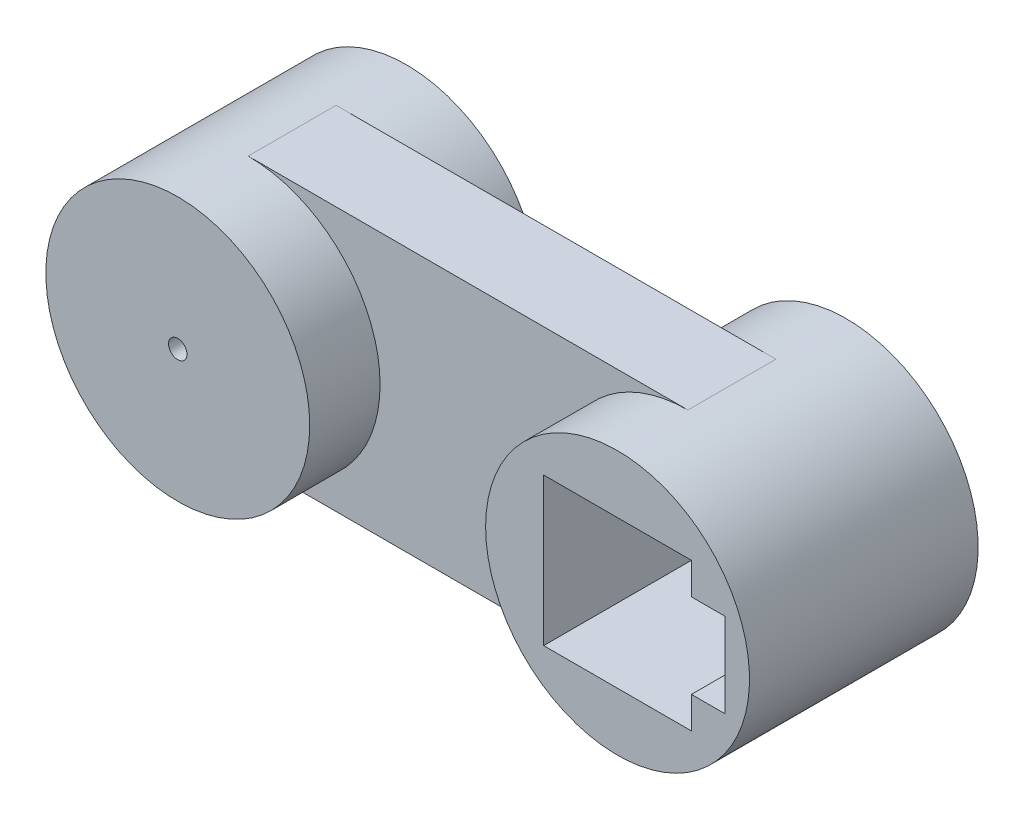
ISO-10303-21;
HEADER;
FILE_DESCRIPTION(('STEP AP214'),'2;1');
FILE_NAME('part.step','',(''),(''),'','','');
FILE_SCHEMA(('AUTOMOTIVE_DESIGN { 1 0 10303 214 1 1 1 1 }'));
ENDSEC;
DATA;
#1=APPLICATION_CONTEXT('core data for automotive mechanical design processes');
#2=APPLICATION_PROTOCOL_DEFINITION('international standard','automotive_design',2000,#1);
#3=PRODUCT_CONTEXT('',#1,'mechanical');
#4=PRODUCT('Part','Part','',(#3));
#5=PRODUCT_RELATED_PRODUCT_CATEGORY('part','',(#4));
#6=PRODUCT_DEFINITION_FORMATION('','',#4);
#7=PRODUCT_DEFINITION_CONTEXT('part definition',#1,'design');
#8=PRODUCT_DEFINITION('design','',#6,#7);
#9=PRODUCT_DEFINITION_SHAPE('','',#8);
#10=(LENGTH_UNIT() NAMED_UNIT(*) SI_UNIT(.MILLI.,.METRE.));
#11=(NAMED_UNIT(*) PLANE_ANGLE_UNIT() SI_UNIT($,.RADIAN.));
#12=(NAMED_UNIT(*) SI_UNIT($,.STERADIAN.) SOLID_ANGLE_UNIT());
#13=UNCERTAINTY_MEASURE_WITH_UNIT(LENGTH_MEASURE(1.E-05),#10,'distance_accuracy_value','');
#14=(GEOMETRIC_REPRESENTATION_CONTEXT(3) GLOBAL_UNCERTAINTY_ASSIGNED_CONTEXT((#13)) GLOBAL_UNIT_ASSIGNED_CONTEXT((#10,
#11,#12)) REPRESENTATION_CONTEXT('',''));
#15=CARTESIAN_POINT('',(0.,0.,0.));
#16=DIRECTION('',(0.,0.,1.));
#17=DIRECTION('',(1.,0.,0.));
#18=AXIS2_PLACEMENT_3D('',#15,#16,#17);
#19=CARTESIAN_POINT('',(0.,0.,33.02));
#20=DIRECTION('',(0.,0.,-1.));
#21=DIRECTION('',(-1.,0.,0.));
#22=AXIS2_PLACEMENT_3D('',#19,#20,#21);
#23=CYLINDRICAL_SURFACE('',#22,38.1);
#24=CARTESIAN_POINT('',(0.,0.,-33.02));
#25=DIRECTION('',(0.,0.,1.));
#26=DIRECTION('',(1.,0.,0.));
#27=AXIS2_PLACEMENT_3D('',#24,#25,#26);
#28=CIRCLE('',#27,38.1);
#29=CARTESIAN_POINT('',(38.1,0.,-33.02));
#30=VERTEX_POINT('',#29);
#31=EDGE_CURVE('E49',#30,#30,#28,.T.);
#32=ORIENTED_EDGE('',*,*,#31,.T.);
#33=EDGE_LOOP('',(#32));
#34=FACE_BOUND('',#33,.T.);
#35=CARTESIAN_POINT('',(0.,0.,33.02));
#36=DIRECTION('',(0.,0.,1.));
#37=DIRECTION('',(1.,0.,0.));
#38=AXIS2_PLACEMENT_3D('',#35,#36,#37);
#39=CIRCLE('',#38,38.1);
#40=CARTESIAN_POINT('',(38.1,0.,33.02));
#41=VERTEX_POINT('',#40);
#42=EDGE_CURVE('E11',#41,#41,#39,.T.);
#43=ORIENTED_EDGE('',*,*,#42,.F.);
#44=EDGE_LOOP('',(#43));
#45=FACE_BOUND('',#44,.T.);
#46=DIRECTION('',(0.,0.,-1.));
#47=VECTOR('',#46,1.);
#48=CARTESIAN_POINT('',(0.,-38.1,12.7));
#49=LINE('',#48,#47);
#50=CARTESIAN_POINT('',(0.,-38.1,12.7));
#51=VERTEX_POINT('',#50);
#52=CARTESIAN_POINT('',(0.,-38.1,-12.7));
#53=VERTEX_POINT('',#52);
#54=EDGE_CURVE('E69',#51,#53,#49,.T.);
#55=ORIENTED_EDGE('',*,*,#54,.F.);
#56=CARTESIAN_POINT('',(0.,0.,12.7));
#57=DIRECTION('',(0.,0.,1.));
#58=DIRECTION('',(1.,0.,0.));
#59=AXIS2_PLACEMENT_3D('',#56,#57,#58);
#60=CIRCLE('',#59,38.1);
#61=CARTESIAN_POINT('',(0.,38.1,12.7));
#62=VERTEX_POINT('',#61);
#63=EDGE_CURVE('E245',#51,#62,#60,.T.);
#64=ORIENTED_EDGE('',*,*,#63,.T.);
#65=DIRECTION('',(0.,0.,-1.));
#66=VECTOR('',#65,1.);
#67=CARTESIAN_POINT('',(0.,38.1,12.7));
#68=LINE('',#67,#66);
#69=CARTESIAN_POINT('',(0.,38.1,-12.7));
#70=VERTEX_POINT('',#69);
#71=EDGE_CURVE('E259',#62,#70,#68,.T.);
#72=ORIENTED_EDGE('',*,*,#71,.T.);
#73=CARTESIAN_POINT('',(0.,0.,-12.7));
#74=DIRECTION('',(0.,0.,1.));
#75=DIRECTION('',(1.,0.,0.));
#76=AXIS2_PLACEMENT_3D('',#73,#74,#75);
#77=CIRCLE('',#76,38.1);
#78=EDGE_CURVE('E238',#53,#70,#77,.T.);
#79=ORIENTED_EDGE('',*,*,#78,.F.);
#80=EDGE_LOOP('',(#55,#64,#72,#79));
#81=FACE_BOUND('',#80,.T.);
#82=ADVANCED_FACE('F50',(#34,#45,#81),#23,.T.);
#83=CARTESIAN_POINT('',(0.,1.905,7.62));
#84=DIRECTION('',(0.,-1.,0.));
#85=DIRECTION('',(0.,0.,-1.));
#86=AXIS2_PLACEMENT_3D('',#83,#84,#85);
#87=PLANE('',#86);
#88=DIRECTION('',(0.,0.,1.));
#89=VECTOR('',#88,1.);
#90=CARTESIAN_POINT('',(1.86651118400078,1.905,7.62));
#91=LINE('',#90,#89);
#92=CARTESIAN_POINT('',(1.86651118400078,1.905,7.62));
#93=VERTEX_POINT('',#92);
#94=CARTESIAN_POINT('',(1.86651118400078,1.905,27.432));
#95=VERTEX_POINT('',#94);
#96=EDGE_CURVE('E302',#93,#95,#91,.T.);
#97=ORIENTED_EDGE('',*,*,#96,.T.);
#98=DIRECTION('',(-1.,0.,0.));
#99=VECTOR('',#98,1.);
#100=CARTESIAN_POINT('',(0.,1.905,27.432));
#101=LINE('',#100,#99);
#102=CARTESIAN_POINT('',(-1.86651118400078,1.905,27.432));
#103=VERTEX_POINT('',#102);
#104=EDGE_CURVE('E288',#95,#103,#101,.T.);
#105=ORIENTED_EDGE('',*,*,#104,.T.);
#106=DIRECTION('',(0.,0.,1.));
#107=VECTOR('',#106,1.);
#108=CARTESIAN_POINT('',(-1.86651118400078,1.905,7.62));
#109=LINE('',#108,#107);
#110=CARTESIAN_POINT('',(-1.86651118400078,1.905,7.62));
#111=VERTEX_POINT('',#110);
#112=EDGE_CURVE('E296',#111,#103,#109,.T.);
#113=ORIENTED_EDGE('',*,*,#112,.F.);
#114=DIRECTION('',(1.,0.,0.));
#115=VECTOR('',#114,1.);
#116=CARTESIAN_POINT('',(0.,1.905,7.62));
#117=LINE('',#116,#115);
#118=EDGE_CURVE('E291',#111,#93,#117,.T.);
#119=ORIENTED_EDGE('',*,*,#118,.T.);
#120=EDGE_LOOP('',(#97,#105,#113,#119));
#121=FACE_BOUND('',#120,.T.);
#122=ADVANCED_FACE('F320',(#121),#87,.T.);
#123=CARTESIAN_POINT('',(0.,0.,33.02));
#124=DIRECTION('',(0.,0.,1.));
#125=DIRECTION('',(1.,0.,0.));
#126=AXIS2_PLACEMENT_3D('',#123,#124,#125);
#127=PLANE('',#126);
#128=CARTESIAN_POINT('',(0.,0.,33.02));
#129=DIRECTION('',(0.,0.,1.));
#130=DIRECTION('',(1.,0.,0.));
#131=AXIS2_PLACEMENT_3D('',#128,#129,#130);
#132=CIRCLE('',#131,2.667);
#133=CARTESIAN_POINT('',(2.667,0.,33.02));
#134=VERTEX_POINT('',#133);
#135=EDGE_CURVE('E295',#134,#134,#132,.T.);
#136=ORIENTED_EDGE('',*,*,#135,.F.);
#137=EDGE_LOOP('',(#136));
#138=FACE_BOUND('',#137,.T.);
#139=ORIENTED_EDGE('',*,*,#42,.T.);
#140=EDGE_LOOP('',(#139));
#141=FACE_BOUND('',#140,.T.);
#142=ADVANCED_FACE('F336',(#138,#141),#127,.T.);
#143=CARTESIAN_POINT('',(0.,0.,-33.02));
#144=DIRECTION('',(0.,0.,1.));
#145=DIRECTION('',(1.,0.,0.));
#146=AXIS2_PLACEMENT_3D('',#143,#144,#145);
#147=PLANE('',#146);
#148=ORIENTED_EDGE('',*,*,#31,.F.);
#149=EDGE_LOOP('',(#148));
#150=FACE_BOUND('',#149,.T.);
#151=ADVANCED_FACE('F335',(#150),#147,.F.);
#152=CARTESIAN_POINT('',(0.,0.,7.62));
#153=DIRECTION('',(0.,0.,1.));
#154=DIRECTION('',(1.,0.,0.));
#155=AXIS2_PLACEMENT_3D('',#152,#153,#154);
#156=CYLINDRICAL_SURFACE('',#155,2.667);
#157=ORIENTED_EDGE('',*,*,#135,.T.);
#158=EDGE_LOOP('',(#157));
#159=FACE_BOUND('',#158,.T.);
#160=ORIENTED_EDGE('',*,*,#112,.T.);
#161=CARTESIAN_POINT('',(0.,0.,27.432));
#162=DIRECTION('',(0.,0.,1.));
#163=DIRECTION('',(1.,0.,0.));
#164=AXIS2_PLACEMENT_3D('',#161,#162,#163);
#165=CIRCLE('',#164,2.667);
#166=EDGE_CURVE('E281',#95,#103,#165,.T.);
#167=ORIENTED_EDGE('',*,*,#166,.F.);
#168=ORIENTED_EDGE('',*,*,#96,.F.);
#169=CARTESIAN_POINT('',(0.,0.,7.62));
#170=DIRECTION('',(0.,0.,1.));
#171=DIRECTION('',(1.,0.,0.));
#172=AXIS2_PLACEMENT_3D('',#169,#170,#171);
#173=CIRCLE('',#172,2.667);
#174=EDGE_CURVE('E298',#111,#93,#173,.T.);
#175=ORIENTED_EDGE('',*,*,#174,.F.);
#176=EDGE_LOOP('',(#160,#167,#168,#175));
#177=FACE_BOUND('',#176,.T.);
#178=ADVANCED_FACE('F311',(#159,#177),#156,.F.);
#179=CARTESIAN_POINT('',(0.,0.,7.62));
#180=DIRECTION('',(0.,0.,1.));
#181=DIRECTION('',(1.,0.,0.));
#182=AXIS2_PLACEMENT_3D('',#179,#180,#181);
#183=PLANE('',#182);
#184=ORIENTED_EDGE('',*,*,#118,.F.);
#185=ORIENTED_EDGE('',*,*,#174,.T.);
#186=EDGE_LOOP('',(#184,#185));
#187=FACE_BOUND('',#186,.T.);
#188=ADVANCED_FACE('F317',(#187),#183,.T.);
#189=CARTESIAN_POINT('',(0.,0.,27.432));
#190=DIRECTION('',(0.,0.,1.));
#191=DIRECTION('',(1.,0.,0.));
#192=AXIS2_PLACEMENT_3D('',#189,#190,#191);
#193=PLANE('',#192);
#194=ORIENTED_EDGE('',*,*,#166,.T.);
#195=ORIENTED_EDGE('',*,*,#104,.F.);
#196=EDGE_LOOP('',(#194,#195));
#197=FACE_BOUND('',#196,.T.);
#198=ADVANCED_FACE('F321',(#197),#193,.T.);
#199=CARTESIAN_POINT('',(0.,-38.1,12.7));
#200=DIRECTION('',(0.,1.,0.));
#201=DIRECTION('',(0.,0.,1.));
#202=AXIS2_PLACEMENT_3D('',#199,#200,#201);
#203=PLANE('',#202);
#204=DIRECTION('',(1.,0.,0.));
#205=VECTOR('',#204,1.);
#206=CARTESIAN_POINT('',(0.,-38.1,-12.7));
#207=LINE('',#206,#205);
#208=CARTESIAN_POINT('',(127.,-38.1,-12.7));
#209=VERTEX_POINT('',#208);
#210=EDGE_CURVE('E263',#53,#209,#207,.T.);
#211=ORIENTED_EDGE('',*,*,#210,.T.);
#212=DIRECTION('',(0.,0.,-1.));
#213=VECTOR('',#212,1.);
#214=CARTESIAN_POINT('',(127.,-38.1,12.7));
#215=LINE('',#214,#213);
#216=CARTESIAN_POINT('',(127.,-38.1,12.7));
#217=VERTEX_POINT('',#216);
#218=EDGE_CURVE('E278',#217,#209,#215,.T.);
#219=ORIENTED_EDGE('',*,*,#218,.F.);
#220=DIRECTION('',(1.,0.,0.));
#221=VECTOR('',#220,1.);
#222=CARTESIAN_POINT('',(0.,-38.1,12.7));
#223=LINE('',#222,#221);
#224=EDGE_CURVE('E250',#51,#217,#223,.T.);
#225=ORIENTED_EDGE('',*,*,#224,.F.);
#226=ORIENTED_EDGE('',*,*,#54,.T.);
#227=EDGE_LOOP('',(#211,#219,#225,#226));
#228=FACE_BOUND('',#227,.T.);
#229=ADVANCED_FACE('F327',(#228),#203,.F.);
#230=CARTESIAN_POINT('',(0.,38.1,12.7));
#231=DIRECTION('',(0.,1.,0.));
#232=DIRECTION('',(0.,0.,1.));
#233=AXIS2_PLACEMENT_3D('',#230,#231,#232);
#234=PLANE('',#233);
#235=DIRECTION('',(1.,0.,0.));
#236=VECTOR('',#235,1.);
#237=CARTESIAN_POINT('',(0.,38.1,-12.7));
#238=LINE('',#237,#236);
#239=CARTESIAN_POINT('',(127.,38.1,-12.7));
#240=VERTEX_POINT('',#239);
#241=EDGE_CURVE('E248',#70,#240,#238,.T.);
#242=ORIENTED_EDGE('',*,*,#241,.F.);
#243=ORIENTED_EDGE('',*,*,#71,.F.);
#244=DIRECTION('',(1.,0.,0.));
#245=VECTOR('',#244,1.);
#246=CARTESIAN_POINT('',(0.,38.1,12.7));
#247=LINE('',#246,#245);
#248=CARTESIAN_POINT('',(127.,38.1,12.7));
#249=VERTEX_POINT('',#248);
#250=EDGE_CURVE('E254',#62,#249,#247,.T.);
#251=ORIENTED_EDGE('',*,*,#250,.T.);
#252=DIRECTION('',(0.,0.,-1.));
#253=VECTOR('',#252,1.);
#254=CARTESIAN_POINT('',(127.,38.1,12.7));
#255=LINE('',#254,#253);
#256=EDGE_CURVE('E277',#249,#240,#255,.T.);
#257=ORIENTED_EDGE('',*,*,#256,.T.);
#258=EDGE_LOOP('',(#242,#243,#251,#257));
#259=FACE_BOUND('',#258,.T.);
#260=ADVANCED_FACE('F396',(#259),#234,.T.);
#261=CARTESIAN_POINT('',(0.,0.,12.7));
#262=DIRECTION('',(0.,0.,1.));
#263=DIRECTION('',(1.,0.,0.));
#264=AXIS2_PLACEMENT_3D('',#261,#262,#263);
#265=PLANE('',#264);
#266=ORIENTED_EDGE('',*,*,#63,.F.);
#267=ORIENTED_EDGE('',*,*,#224,.T.);
#268=CARTESIAN_POINT('',(127.,0.,12.7));
#269=DIRECTION('',(0.,0.,1.));
#270=DIRECTION('',(1.,0.,0.));
#271=AXIS2_PLACEMENT_3D('',#268,#269,#270);
#272=CIRCLE('',#271,38.1);
#273=EDGE_CURVE('E252',#249,#217,#272,.T.);
#274=ORIENTED_EDGE('',*,*,#273,.F.);
#275=ORIENTED_EDGE('',*,*,#250,.F.);
#276=EDGE_LOOP('',(#266,#267,#274,#275));
#277=FACE_BOUND('',#276,.T.);
#278=ADVANCED_FACE('F403',(#277),#265,.T.);
#279=CARTESIAN_POINT('',(0.,0.,-12.7));
#280=DIRECTION('',(0.,0.,1.));
#281=DIRECTION('',(1.,0.,0.));
#282=AXIS2_PLACEMENT_3D('',#279,#280,#281);
#283=PLANE('',#282);
#284=ORIENTED_EDGE('',*,*,#78,.T.);
#285=ORIENTED_EDGE('',*,*,#241,.T.);
#286=CARTESIAN_POINT('',(127.,0.,-12.7));
#287=DIRECTION('',(0.,0.,1.));
#288=DIRECTION('',(1.,0.,0.));
#289=AXIS2_PLACEMENT_3D('',#286,#287,#288);
#290=CIRCLE('',#289,38.1);
#291=EDGE_CURVE('E270',#240,#209,#290,.T.);
#292=ORIENTED_EDGE('',*,*,#291,.T.);
#293=ORIENTED_EDGE('',*,*,#210,.F.);
#294=EDGE_LOOP('',(#284,#285,#292,#293));
#295=FACE_BOUND('',#294,.T.);
#296=ADVANCED_FACE('F412',(#295),#283,.F.);
#297=CARTESIAN_POINT('',(127.,0.,33.02));
#298=DIRECTION('',(0.,0.,-1.));
#299=DIRECTION('',(-1.,0.,0.));
#300=AXIS2_PLACEMENT_3D('',#297,#298,#299);
#301=CYLINDRICAL_SURFACE('',#300,38.1);
#302=CARTESIAN_POINT('',(127.,0.,-33.02));
#303=DIRECTION('',(0.,0.,-1.));
#304=DIRECTION('',(-1.,0.,0.));
#305=AXIS2_PLACEMENT_3D('',#302,#303,#304);
#306=CIRCLE('',#305,38.1);
#307=CARTESIAN_POINT('',(88.9,0.,-33.02));
#308=VERTEX_POINT('',#307);
#309=EDGE_CURVE('E217',#308,#308,#306,.T.);
#310=ORIENTED_EDGE('',*,*,#309,.F.);
#311=EDGE_LOOP('',(#310));
#312=FACE_BOUND('',#311,.T.);
#313=CARTESIAN_POINT('',(127.,0.,33.02));
#314=DIRECTION('',(0.,0.,-1.));
#315=DIRECTION('',(-1.,0.,0.));
#316=AXIS2_PLACEMENT_3D('',#313,#314,#315);
#317=CIRCLE('',#316,38.1);
#318=CARTESIAN_POINT('',(88.9,0.,33.02));
#319=VERTEX_POINT('',#318);
#320=EDGE_CURVE('E237',#319,#319,#317,.T.);
#321=ORIENTED_EDGE('',*,*,#320,.T.);
#322=EDGE_LOOP('',(#321));
#323=FACE_BOUND('',#322,.T.);
#324=ORIENTED_EDGE('',*,*,#256,.F.);
#325=ORIENTED_EDGE('',*,*,#273,.T.);
#326=ORIENTED_EDGE('',*,*,#218,.T.);
#327=ORIENTED_EDGE('',*,*,#291,.F.);
#328=EDGE_LOOP('',(#324,#325,#326,#327));
#329=FACE_BOUND('',#328,.T.);
#330=ADVANCED_FACE('F421',(#312,#323,#329),#301,.T.);
#331=CARTESIAN_POINT('',(127.,0.,33.02));
#332=DIRECTION('',(0.,0.,1.));
#333=DIRECTION('',(-1.,0.,0.));
#334=AXIS2_PLACEMENT_3D('',#331,#332,#333);
#335=PLANE('',#334);
#336=DIRECTION('',(1.,0.,0.));
#337=VECTOR('',#336,1.);
#338=CARTESIAN_POINT('',(0.,-21.336,33.02));
#339=LINE('',#338,#337);
#340=CARTESIAN_POINT('',(105.664,-21.336,33.02));
#341=VERTEX_POINT('',#340);
#342=CARTESIAN_POINT('',(148.336,-21.336,33.02));
#343=VERTEX_POINT('',#342);
#344=EDGE_CURVE('E64',#341,#343,#339,.T.);
#345=ORIENTED_EDGE('',*,*,#344,.F.);
#346=DIRECTION('',(0.,1.,0.));
#347=VECTOR('',#346,1.);
#348=CARTESIAN_POINT('',(105.664,0.,33.02));
#349=LINE('',#348,#347);
#350=CARTESIAN_POINT('',(105.664,21.336,33.02));
#351=VERTEX_POINT('',#350);
#352=EDGE_CURVE('E174',#341,#351,#349,.T.);
#353=ORIENTED_EDGE('',*,*,#352,.T.);
#354=DIRECTION('',(1.,0.,0.));
#355=VECTOR('',#354,1.);
#356=CARTESIAN_POINT('',(0.,21.336,33.02));
#357=LINE('',#356,#355);
#358=CARTESIAN_POINT('',(148.336,21.336,33.02));
#359=VERTEX_POINT('',#358);
#360=EDGE_CURVE('E176',#351,#359,#357,.T.);
#361=ORIENTED_EDGE('',*,*,#360,.T.);
#362=DIRECTION('',(0.,1.,0.));
#363=VECTOR('',#362,1.);
#364=CARTESIAN_POINT('',(148.336,0.,33.02));
#365=LINE('',#364,#363);
#366=CARTESIAN_POINT('',(148.336,12.192,33.02));
#367=VERTEX_POINT('',#366);
#368=EDGE_CURVE('E199',#367,#359,#365,.T.);
#369=ORIENTED_EDGE('',*,*,#368,.F.);
#370=DIRECTION('',(-1.,0.,0.));
#371=VECTOR('',#370,1.);
#372=CARTESIAN_POINT('',(0.,12.192,33.02));
#373=LINE('',#372,#371);
#374=CARTESIAN_POINT('',(157.988,12.192,33.02));
#375=VERTEX_POINT('',#374);
#376=EDGE_CURVE('E208',#375,#367,#373,.T.);
#377=ORIENTED_EDGE('',*,*,#376,.F.);
#378=DIRECTION('',(0.,1.,0.));
#379=VECTOR('',#378,1.);
#380=CARTESIAN_POINT('',(157.988,0.,33.02));
#381=LINE('',#380,#379);
#382=CARTESIAN_POINT('',(157.988,-12.192,33.02));
#383=VERTEX_POINT('',#382);
#384=EDGE_CURVE('E204',#383,#375,#381,.T.);
#385=ORIENTED_EDGE('',*,*,#384,.F.);
#386=DIRECTION('',(-1.,0.,0.));
#387=VECTOR('',#386,1.);
#388=CARTESIAN_POINT('',(0.,-12.192,33.02));
#389=LINE('',#388,#387);
#390=CARTESIAN_POINT('',(148.336,-12.192,33.02));
#391=VERTEX_POINT('',#390);
#392=EDGE_CURVE('E200',#383,#391,#389,.T.);
#393=ORIENTED_EDGE('',*,*,#392,.T.);
#394=EDGE_CURVE('E198',#343,#391,#365,.T.);
#395=ORIENTED_EDGE('',*,*,#394,.F.);
#396=EDGE_LOOP('',(#345,#353,#361,#369,#377,#385,#393,#395));
#397=FACE_BOUND('',#396,.T.);
#398=ORIENTED_EDGE('',*,*,#320,.F.);
#399=EDGE_LOOP('',(#398));
#400=FACE_BOUND('',#399,.T.);
#401=ADVANCED_FACE('F435',(#397,#400),#335,.T.);
#402=CARTESIAN_POINT('',(127.,0.,-33.02));
#403=DIRECTION('',(0.,0.,1.));
#404=DIRECTION('',(-1.,0.,0.));
#405=AXIS2_PLACEMENT_3D('',#402,#403,#404);
#406=PLANE('',#405);
#407=ORIENTED_EDGE('',*,*,#309,.T.);
#408=EDGE_LOOP('',(#407));
#409=FACE_BOUND('',#408,.T.);
#410=ADVANCED_FACE('F442',(#409),#406,.F.);
#411=CARTESIAN_POINT('',(0.,-21.336,-26.924));
#412=DIRECTION('',(0.,-1.,0.));
#413=DIRECTION('',(0.,0.,-1.));
#414=AXIS2_PLACEMENT_3D('',#411,#412,#413);
#415=PLANE('',#414);
#416=ORIENTED_EDGE('',*,*,#344,.T.);
#417=DIRECTION('',(0.,0.,1.));
#418=VECTOR('',#417,1.);
#419=CARTESIAN_POINT('',(148.336,-21.336,-26.924));
#420=LINE('',#419,#418);
#421=CARTESIAN_POINT('',(148.336,-21.336,-26.924));
#422=VERTEX_POINT('',#421);
#423=EDGE_CURVE('E148',#422,#343,#420,.T.);
#424=ORIENTED_EDGE('',*,*,#423,.F.);
#425=DIRECTION('',(1.,0.,0.));
#426=VECTOR('',#425,1.);
#427=CARTESIAN_POINT('',(0.,-21.336,-26.924));
#428=LINE('',#427,#426);
#429=CARTESIAN_POINT('',(105.664,-21.336,-26.924));
#430=VERTEX_POINT('',#429);
#431=EDGE_CURVE('E147',#430,#422,#428,.T.);
#432=ORIENTED_EDGE('',*,*,#431,.F.);
#433=DIRECTION('',(0.,0.,1.));
#434=VECTOR('',#433,1.);
#435=CARTESIAN_POINT('',(105.664,-21.336,-26.924));
#436=LINE('',#435,#434);
#437=EDGE_CURVE('E214',#430,#341,#436,.T.);
#438=ORIENTED_EDGE('',*,*,#437,.T.);
#439=EDGE_LOOP('',(#416,#424,#432,#438));
#440=FACE_BOUND('',#439,.T.);
#441=ADVANCED_FACE('F146',(#440),#415,.F.);
#442=CARTESIAN_POINT('',(105.664,0.,-26.924));
#443=DIRECTION('',(1.,0.,0.));
#444=DIRECTION('',(0.,0.,-1.));
#445=AXIS2_PLACEMENT_3D('',#442,#443,#444);
#446=PLANE('',#445);
#447=ORIENTED_EDGE('',*,*,#352,.F.);
#448=ORIENTED_EDGE('',*,*,#437,.F.);
#449=DIRECTION('',(0.,1.,0.));
#450=VECTOR('',#449,1.);
#451=CARTESIAN_POINT('',(105.664,0.,-26.924));
#452=LINE('',#451,#450);
#453=CARTESIAN_POINT('',(105.664,21.336,-26.924));
#454=VERTEX_POINT('',#453);
#455=EDGE_CURVE('E156',#430,#454,#452,.T.);
#456=ORIENTED_EDGE('',*,*,#455,.T.);
#457=DIRECTION('',(0.,0.,1.));
#458=VECTOR('',#457,1.);
#459=CARTESIAN_POINT('',(105.664,21.336,-26.924));
#460=LINE('',#459,#458);
#461=EDGE_CURVE('E218',#454,#351,#460,.T.);
#462=ORIENTED_EDGE('',*,*,#461,.T.);
#463=EDGE_LOOP('',(#447,#448,#456,#462));
#464=FACE_BOUND('',#463,.T.);
#465=ADVANCED_FACE('F456',(#464),#446,.T.);
#466=CARTESIAN_POINT('',(0.,21.336,-26.924));
#467=DIRECTION('',(0.,-1.,0.));
#468=DIRECTION('',(0.,0.,-1.));
#469=AXIS2_PLACEMENT_3D('',#466,#467,#468);
#470=PLANE('',#469);
#471=ORIENTED_EDGE('',*,*,#360,.F.);
#472=ORIENTED_EDGE('',*,*,#461,.F.);
#473=DIRECTION('',(1.,0.,0.));
#474=VECTOR('',#473,1.);
#475=CARTESIAN_POINT('',(0.,21.336,-26.924));
#476=LINE('',#475,#474);
#477=CARTESIAN_POINT('',(148.336,21.336,-26.924));
#478=VERTEX_POINT('',#477);
#479=EDGE_CURVE('E190',#454,#478,#476,.T.);
#480=ORIENTED_EDGE('',*,*,#479,.T.);
#481=DIRECTION('',(0.,0.,1.));
#482=VECTOR('',#481,1.);
#483=CARTESIAN_POINT('',(148.336,21.336,-26.924));
#484=LINE('',#483,#482);
#485=EDGE_CURVE('E225',#478,#359,#484,.T.);
#486=ORIENTED_EDGE('',*,*,#485,.T.);
#487=EDGE_LOOP('',(#471,#472,#480,#486));
#488=FACE_BOUND('',#487,.T.);
#489=ADVANCED_FACE('F466',(#488),#470,.T.);
#490=CARTESIAN_POINT('',(148.336,0.,-26.924));
#491=DIRECTION('',(1.,0.,0.));
#492=DIRECTION('',(0.,0.,-1.));
#493=AXIS2_PLACEMENT_3D('',#490,#491,#492);
#494=PLANE('',#493);
#495=ORIENTED_EDGE('',*,*,#368,.T.);
#496=ORIENTED_EDGE('',*,*,#485,.F.);
#497=DIRECTION('',(0.,1.,0.));
#498=VECTOR('',#497,1.);
#499=CARTESIAN_POINT('',(148.336,0.,-26.924));
#500=LINE('',#499,#498);
#501=CARTESIAN_POINT('',(148.336,12.192,-26.924));
#502=VERTEX_POINT('',#501);
#503=EDGE_CURVE('E170',#502,#478,#500,.T.);
#504=ORIENTED_EDGE('',*,*,#503,.F.);
#505=DIRECTION('',(0.,0.,1.));
#506=VECTOR('',#505,1.);
#507=CARTESIAN_POINT('',(148.336,12.192,-26.924));
#508=LINE('',#507,#506);
#509=EDGE_CURVE('E223',#502,#367,#508,.T.);
#510=ORIENTED_EDGE('',*,*,#509,.T.);
#511=EDGE_LOOP('',(#495,#496,#504,#510));
#512=FACE_BOUND('',#511,.T.);
#513=ADVANCED_FACE('F474',(#512),#494,.F.);
#514=CARTESIAN_POINT('',(0.,12.192,-26.924));
#515=DIRECTION('',(0.,1.,0.));
#516=DIRECTION('',(-1.,0.,0.));
#517=AXIS2_PLACEMENT_3D('',#514,#515,#516);
#518=PLANE('',#517);
#519=ORIENTED_EDGE('',*,*,#376,.T.);
#520=ORIENTED_EDGE('',*,*,#509,.F.);
#521=DIRECTION('',(-1.,0.,0.));
#522=VECTOR('',#521,1.);
#523=CARTESIAN_POINT('',(0.,12.192,-26.924));
#524=LINE('',#523,#522);
#525=CARTESIAN_POINT('',(157.988,12.192,-26.924));
#526=VERTEX_POINT('',#525);
#527=EDGE_CURVE('E183',#526,#502,#524,.T.);
#528=ORIENTED_EDGE('',*,*,#527,.F.);
#529=DIRECTION('',(0.,0.,1.));
#530=VECTOR('',#529,1.);
#531=CARTESIAN_POINT('',(157.988,12.192,-26.924));
#532=LINE('',#531,#530);
#533=EDGE_CURVE('E227',#526,#375,#532,.T.);
#534=ORIENTED_EDGE('',*,*,#533,.T.);
#535=EDGE_LOOP('',(#519,#520,#528,#534));
#536=FACE_BOUND('',#535,.T.);
#537=ADVANCED_FACE('F482',(#536),#518,.F.);
#538=CARTESIAN_POINT('',(157.988,0.,-26.924));
#539=DIRECTION('',(1.,0.,0.));
#540=DIRECTION('',(0.,0.,-1.));
#541=AXIS2_PLACEMENT_3D('',#538,#539,#540);
#542=PLANE('',#541);
#543=ORIENTED_EDGE('',*,*,#384,.T.);
#544=ORIENTED_EDGE('',*,*,#533,.F.);
#545=DIRECTION('',(0.,1.,0.));
#546=VECTOR('',#545,1.);
#547=CARTESIAN_POINT('',(157.988,0.,-26.924));
#548=LINE('',#547,#546);
#549=CARTESIAN_POINT('',(157.988,-12.192,-26.924));
#550=VERTEX_POINT('',#549);
#551=EDGE_CURVE('E182',#550,#526,#548,.T.);
#552=ORIENTED_EDGE('',*,*,#551,.F.);
#553=DIRECTION('',(0.,0.,1.));
#554=VECTOR('',#553,1.);
#555=CARTESIAN_POINT('',(157.988,-12.192,-26.924));
#556=LINE('',#555,#554);
#557=EDGE_CURVE('E231',#550,#383,#556,.T.);
#558=ORIENTED_EDGE('',*,*,#557,.T.);
#559=EDGE_LOOP('',(#543,#544,#552,#558));
#560=FACE_BOUND('',#559,.T.);
#561=ADVANCED_FACE('F493',(#560),#542,.F.);
#562=CARTESIAN_POINT('',(0.,-12.192,-26.924));
#563=DIRECTION('',(0.,1.,0.));
#564=DIRECTION('',(-1.,0.,0.));
#565=AXIS2_PLACEMENT_3D('',#562,#563,#564);
#566=PLANE('',#565);
#567=ORIENTED_EDGE('',*,*,#392,.F.);
#568=ORIENTED_EDGE('',*,*,#557,.F.);
#569=DIRECTION('',(-1.,0.,0.));
#570=VECTOR('',#569,1.);
#571=CARTESIAN_POINT('',(0.,-12.192,-26.924));
#572=LINE('',#571,#570);
#573=CARTESIAN_POINT('',(148.336,-12.192,-26.924));
#574=VERTEX_POINT('',#573);
#575=EDGE_CURVE('E164',#550,#574,#572,.T.);
#576=ORIENTED_EDGE('',*,*,#575,.T.);
#577=DIRECTION('',(0.,0.,1.));
#578=VECTOR('',#577,1.);
#579=CARTESIAN_POINT('',(148.336,-12.192,-26.924));
#580=LINE('',#579,#578);
#581=EDGE_CURVE('E154',#574,#391,#580,.T.);
#582=ORIENTED_EDGE('',*,*,#581,.T.);
#583=EDGE_LOOP('',(#567,#568,#576,#582));
#584=FACE_BOUND('',#583,.T.);
#585=ADVANCED_FACE('F502',(#584),#566,.T.);
#586=ORIENTED_EDGE('',*,*,#394,.T.);
#587=ORIENTED_EDGE('',*,*,#581,.F.);
#588=EDGE_CURVE('E159',#422,#574,#500,.T.);
#589=ORIENTED_EDGE('',*,*,#588,.F.);
#590=ORIENTED_EDGE('',*,*,#423,.T.);
#591=EDGE_LOOP('',(#586,#587,#589,#590));
#592=FACE_BOUND('',#591,.T.);
#593=ADVANCED_FACE('F161',(#592),#494,.F.);
#594=CARTESIAN_POINT('',(0.,0.,-26.924));
#595=DIRECTION('',(0.,0.,1.));
#596=DIRECTION('',(1.,0.,0.));
#597=AXIS2_PLACEMENT_3D('',#594,#595,#596);
#598=PLANE('',#597);
#599=ORIENTED_EDGE('',*,*,#431,.T.);
#600=ORIENTED_EDGE('',*,*,#588,.T.);
#601=ORIENTED_EDGE('',*,*,#575,.F.);
#602=ORIENTED_EDGE('',*,*,#551,.T.);
#603=ORIENTED_EDGE('',*,*,#527,.T.);
#604=ORIENTED_EDGE('',*,*,#503,.T.);
#605=ORIENTED_EDGE('',*,*,#479,.F.);
#606=ORIENTED_EDGE('',*,*,#455,.F.);
#607=EDGE_LOOP('',(#599,#600,#601,#602,#603,#604,#605,#606));
#608=FACE_BOUND('',#607,.T.);
#609=ADVANCED_FACE('F166',(#608),#598,.T.);
#610=CLOSED_SHELL('',(#82,#122,#142,#151,#178,#188,#198,#229,#260,#278,#296,#330,#401,#410,#441,
#465,#489,#513,#537,#561,#585,#593,#609));
#611=MANIFOLD_SOLID_BREP('B2',#610);
#612=ADVANCED_BREP_SHAPE_REPRESENTATION('',(#18,#611),#14);
#613=SHAPE_DEFINITION_REPRESENTATION(#9,#612);
ENDSEC;
END-ISO-10303-21;
